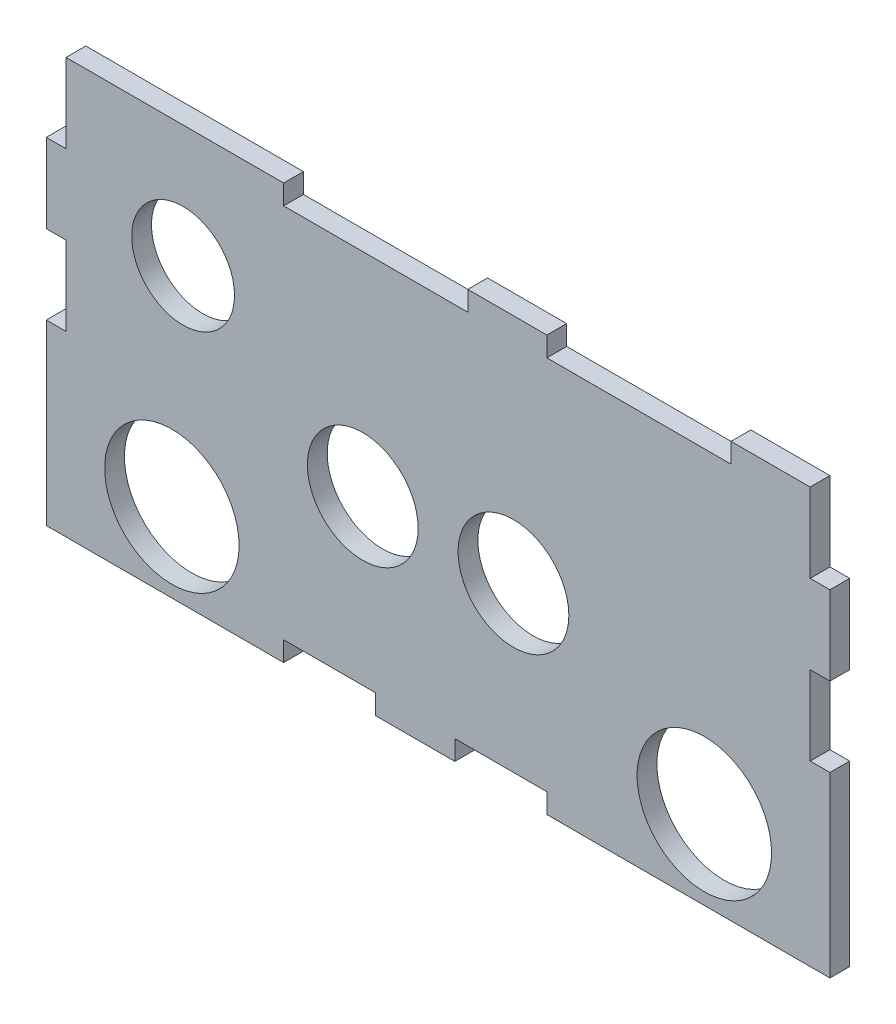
from build123d import *

# Parameters (mm, degrees)
SKETCH1_R           = 17
SKETCH1_R_2         = 14
SKETCH1_R_3         = 13
BOSS_EXTRUDE1_DEPTH = 5


with BuildPart() as part:
    # Sketch1 → Boss-Extrude1 (new body)
    with BuildSketch(Plane.XY):
        Polygon((0, 0), (0, 45), (5, 45), (5, 65), (0, 65), (0, 85), (5, 85), (5, 105), (60, 105), (60, 100), (106.56, 100), (106.56, 105), (126.56, 105), (126.56, 100), (173.12, 100), (173.12, 105), (193.12, 105), (193.12, 85), (198.12, 85), (198.12, 65), (193.12, 65), (193.12, 45), (198.12, 45), (198.12, 0), (126.56, 0), (126.56, 5), (103.28, 5), (103.28, 0), (83.28, 0), (83.28, 5), (60, 5), (60, 0), align=None)
        with Locations((31.75, 20)):
            Circle(SKETCH1_R, mode=Mode.SUBTRACT)
        with Locations((80.01, 46.381288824)):
            Circle(SKETCH1_R_2, mode=Mode.SUBTRACT)
        with Locations((118.11, 46.381288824)):
            Circle(SKETCH1_R_2, mode=Mode.SUBTRACT)
        with Locations((166.37, 20)):
            Circle(SKETCH1_R, mode=Mode.SUBTRACT)
        with Locations((34.591, 74.17555924)):
            Circle(SKETCH1_R_3, mode=Mode.SUBTRACT)
    extrude(amount=BOSS_EXTRUDE1_DEPTH)


solid = part.part
